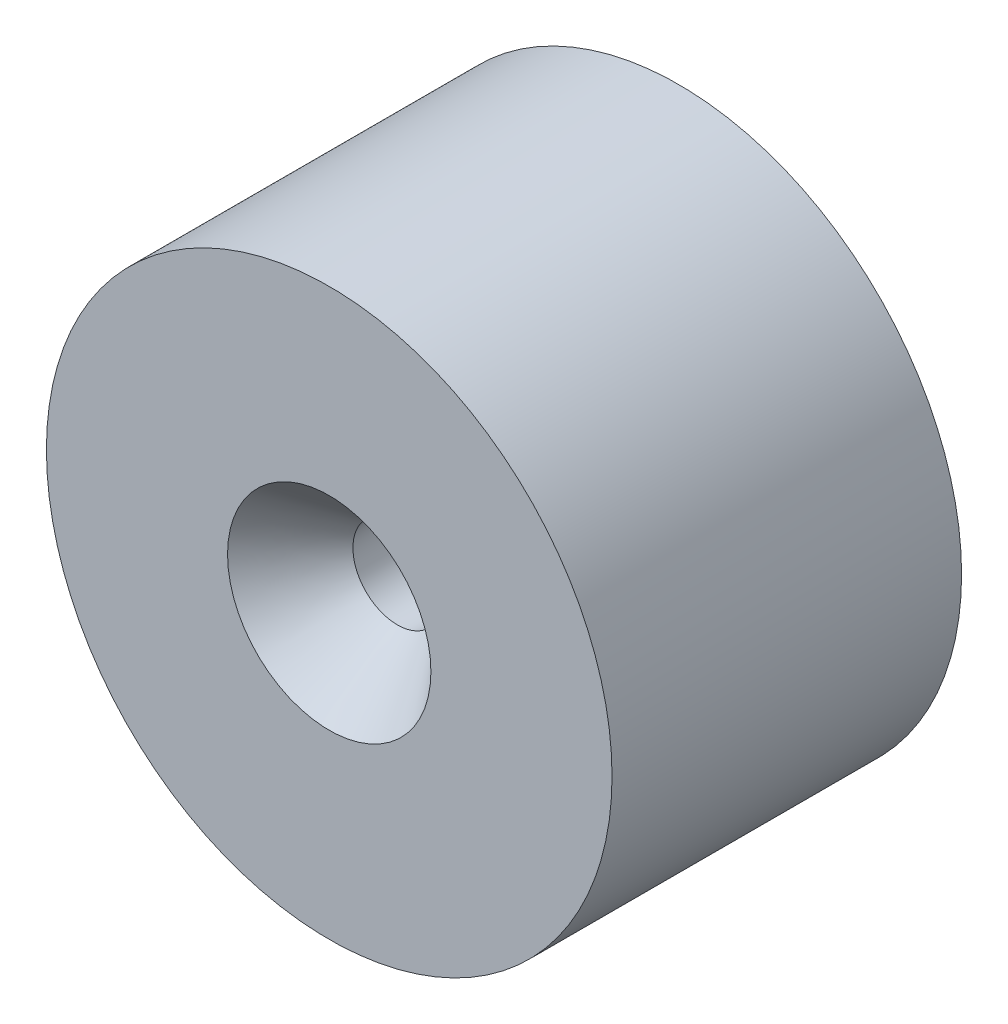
from build123d import *

# Parameters (mm, degrees)
SKETCH1_R                                       = 8.9
SKETCH1_R_2                                     = 1.4
EXTRUDE_THIN1_DEPTH                             = 11
SKETCH4_R                                       = 6.3
SKETCH4_R_2                                     = 3.5
CUT_EXTRUDE1_DEPTH                              = 7
CSK_FOR_M3_FLAT_HEAD_MACHINE_SCREW1_D           = 2.8
CSK_FOR_M3_FLAT_HEAD_MACHINE_SCREW1_DEPTH       = 14
CSK_FOR_M3_FLAT_HEAD_MACHINE_SCREW1_CSINK_D     = 6.4
CSK_FOR_M3_FLAT_HEAD_MACHINE_SCREW1_CSINK_ANGLE = 80
CSK_FOR_M3_FLAT_HEAD_MACHINE_SCREW1_TIP         = 0.841204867


with BuildPart() as part:
    # Sketch1 → Extrude-Thin1 (new body)
    with BuildSketch(Plane.XY):
        Circle(SKETCH1_R)
        Circle(SKETCH1_R_2, mode=Mode.SUBTRACT)
    extrude(amount=EXTRUDE_THIN1_DEPTH)

    # Sketch4 → Cut-Extrude1 (cut)
    with BuildSketch(Plane(origin=(0, 0, 2), x_dir=(-1, 0, 0), z_dir=(0, 0, -1))):
        Circle(SKETCH4_R)
        Circle(SKETCH4_R_2, mode=Mode.SUBTRACT)
    extrude(amount=-CUT_EXTRUDE1_DEPTH, mode=Mode.SUBTRACT)

    # CSK for M3 Flat Head Machine Screw1
    with Locations(Plane.XY.offset(11)):
        with Locations((0, 0)):
            CounterSinkHole(CSK_FOR_M3_FLAT_HEAD_MACHINE_SCREW1_D / 2, CSK_FOR_M3_FLAT_HEAD_MACHINE_SCREW1_CSINK_D / 2, depth=CSK_FOR_M3_FLAT_HEAD_MACHINE_SCREW1_DEPTH, counter_sink_angle=CSK_FOR_M3_FLAT_HEAD_MACHINE_SCREW1_CSINK_ANGLE)
            with Locations((0, 0, -(CSK_FOR_M3_FLAT_HEAD_MACHINE_SCREW1_DEPTH + CSK_FOR_M3_FLAT_HEAD_MACHINE_SCREW1_TIP / 2))):  # 118° drill point
                Cone(0, CSK_FOR_M3_FLAT_HEAD_MACHINE_SCREW1_D / 2, CSK_FOR_M3_FLAT_HEAD_MACHINE_SCREW1_TIP, mode=Mode.SUBTRACT)


solid = part.part
